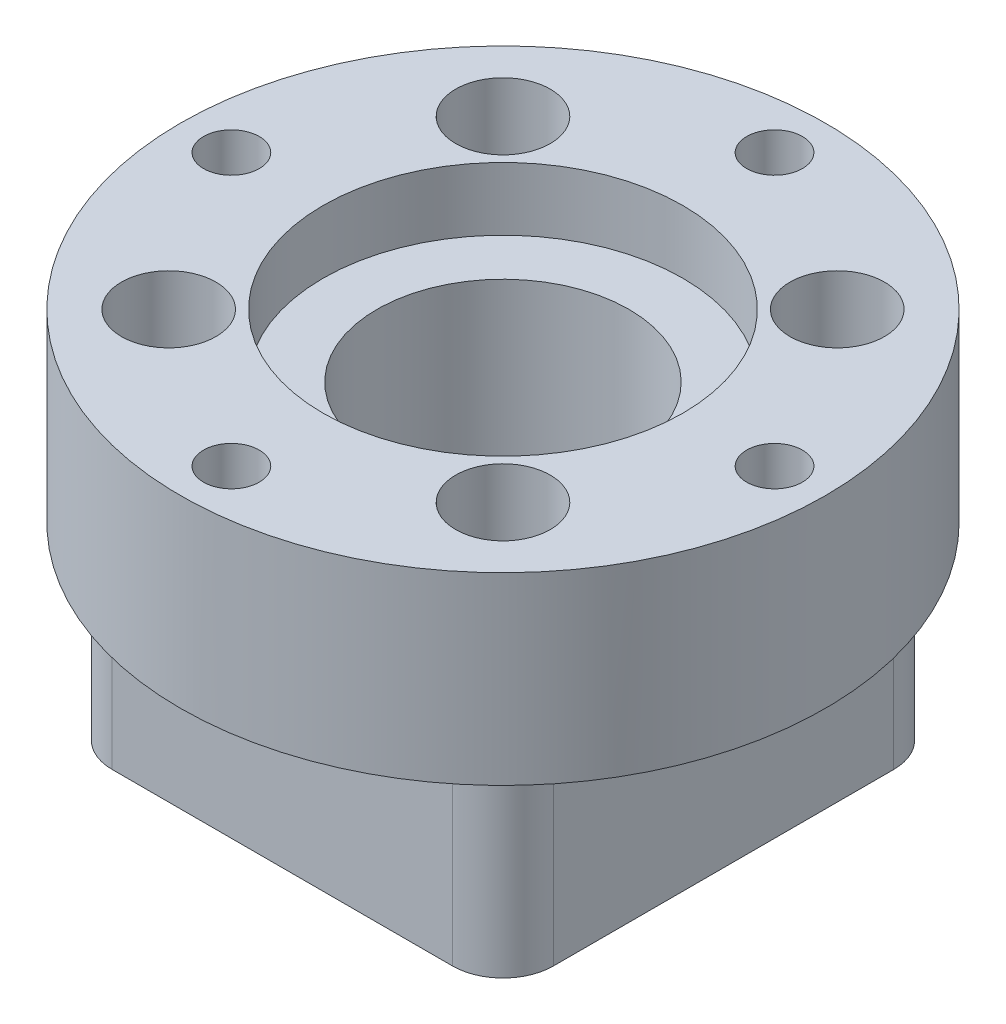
ISO-10303-21;
HEADER;
FILE_DESCRIPTION(('STEP AP214'),'2;1');
FILE_NAME('part.step','',(''),(''),'','','');
FILE_SCHEMA(('AUTOMOTIVE_DESIGN { 1 0 10303 214 1 1 1 1 }'));
ENDSEC;
DATA;
#1=APPLICATION_CONTEXT('core data for automotive mechanical design processes');
#2=APPLICATION_PROTOCOL_DEFINITION('international standard','automotive_design',2000,#1);
#3=PRODUCT_CONTEXT('',#1,'mechanical');
#4=PRODUCT('Part','Part','',(#3));
#5=PRODUCT_RELATED_PRODUCT_CATEGORY('part','',(#4));
#6=PRODUCT_DEFINITION_FORMATION('','',#4);
#7=PRODUCT_DEFINITION_CONTEXT('part definition',#1,'design');
#8=PRODUCT_DEFINITION('design','',#6,#7);
#9=PRODUCT_DEFINITION_SHAPE('','',#8);
#10=(LENGTH_UNIT() NAMED_UNIT(*) SI_UNIT(.MILLI.,.METRE.));
#11=(NAMED_UNIT(*) PLANE_ANGLE_UNIT() SI_UNIT($,.RADIAN.));
#12=(NAMED_UNIT(*) SI_UNIT($,.STERADIAN.) SOLID_ANGLE_UNIT());
#13=UNCERTAINTY_MEASURE_WITH_UNIT(LENGTH_MEASURE(1.E-05),#10,'distance_accuracy_value','');
#14=(GEOMETRIC_REPRESENTATION_CONTEXT(3) GLOBAL_UNCERTAINTY_ASSIGNED_CONTEXT((#13)) GLOBAL_UNIT_ASSIGNED_CONTEXT((#10,
#11,#12)) REPRESENTATION_CONTEXT('',''));
#15=CARTESIAN_POINT('',(0.,0.,0.));
#16=DIRECTION('',(0.,0.,1.));
#17=DIRECTION('',(1.,0.,0.));
#18=AXIS2_PLACEMENT_3D('',#15,#16,#17);
#19=CARTESIAN_POINT('',(0.,0.,0.));
#20=DIRECTION('',(0.,-1.,0.));
#21=DIRECTION('',(0.,0.,-1.));
#22=AXIS2_PLACEMENT_3D('',#19,#20,#21);
#23=PLANE('',#22);
#24=CARTESIAN_POINT('',(16.8401999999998,-4.71844785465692E-13,16.8402000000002));
#25=DIRECTION('',(0.,1.,0.));
#26=DIRECTION('',(0.,0.,1.));
#27=AXIS2_PLACEMENT_3D('',#24,#25,#26);
#28=CIRCLE('',#27,2.55269999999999);
#29=CARTESIAN_POINT('',(16.8401999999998,-4.71844785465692E-13,19.3929000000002));
#30=VERTEX_POINT('',#29);
#31=EDGE_CURVE('E265',#30,#30,#28,.T.);
#32=ORIENTED_EDGE('',*,*,#31,.T.);
#33=EDGE_LOOP('',(#32));
#34=FACE_BOUND('',#33,.T.);
#35=CARTESIAN_POINT('',(16.8402000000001,-4.71844785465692E-13,-16.8402));
#36=DIRECTION('',(0.,1.,0.));
#37=DIRECTION('',(0.,0.,1.));
#38=AXIS2_PLACEMENT_3D('',#35,#36,#37);
#39=CIRCLE('',#38,2.55269999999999);
#40=CARTESIAN_POINT('',(16.8402000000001,-4.71844785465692E-13,-14.2875));
#41=VERTEX_POINT('',#40);
#42=EDGE_CURVE('E253',#41,#41,#39,.T.);
#43=ORIENTED_EDGE('',*,*,#42,.T.);
#44=EDGE_LOOP('',(#43));
#45=FACE_BOUND('',#44,.T.);
#46=CARTESIAN_POINT('',(-16.8401999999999,-4.71844785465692E-13,-16.8402000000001));
#47=DIRECTION('',(0.,1.,0.));
#48=DIRECTION('',(0.,0.,1.));
#49=AXIS2_PLACEMENT_3D('',#46,#47,#48);
#50=CIRCLE('',#49,2.55269999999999);
#51=CARTESIAN_POINT('',(-16.8401999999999,-4.71844785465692E-13,-14.2875000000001));
#52=VERTEX_POINT('',#51);
#53=EDGE_CURVE('E241',#52,#52,#50,.T.);
#54=ORIENTED_EDGE('',*,*,#53,.T.);
#55=EDGE_LOOP('',(#54));
#56=FACE_BOUND('',#55,.T.);
#57=CARTESIAN_POINT('',(-16.8402000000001,-4.71844785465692E-13,16.8402));
#58=DIRECTION('',(0.,1.,0.));
#59=DIRECTION('',(0.,0.,1.));
#60=AXIS2_PLACEMENT_3D('',#57,#58,#59);
#61=CIRCLE('',#60,2.55269999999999);
#62=CARTESIAN_POINT('',(-16.8402000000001,-4.71844785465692E-13,19.3929));
#63=VERTEX_POINT('',#62);
#64=EDGE_CURVE('E229',#63,#63,#61,.T.);
#65=ORIENTED_EDGE('',*,*,#64,.T.);
#66=EDGE_LOOP('',(#65));
#67=FACE_BOUND('',#66,.T.);
#68=DIRECTION('',(0.,0.,1.));
#69=VECTOR('',#68,1.);
#70=CARTESIAN_POINT('',(-22.225,0.,22.225));
#71=LINE('',#70,#69);
#72=CARTESIAN_POINT('',(-22.225,0.,-17.145));
#73=VERTEX_POINT('',#72);
#74=CARTESIAN_POINT('',(-22.225,0.,17.145));
#75=VERTEX_POINT('',#74);
#76=EDGE_CURVE('E149',#73,#75,#71,.T.);
#77=ORIENTED_EDGE('',*,*,#76,.F.);
#78=CARTESIAN_POINT('',(-17.145,0.,-17.145));
#79=DIRECTION('',(0.,-1.,0.));
#80=DIRECTION('',(0.,0.,-1.));
#81=AXIS2_PLACEMENT_3D('',#78,#79,#80);
#82=CIRCLE('',#81,5.08);
#83=CARTESIAN_POINT('',(-17.145,0.,-22.225));
#84=VERTEX_POINT('',#83);
#85=EDGE_CURVE('E167',#73,#84,#82,.T.);
#86=ORIENTED_EDGE('',*,*,#85,.T.);
#87=DIRECTION('',(-1.,0.,0.));
#88=VECTOR('',#87,1.);
#89=CARTESIAN_POINT('',(-22.225,0.,-22.225));
#90=LINE('',#89,#88);
#91=CARTESIAN_POINT('',(17.145,0.,-22.225));
#92=VERTEX_POINT('',#91);
#93=EDGE_CURVE('E145',#92,#84,#90,.T.);
#94=ORIENTED_EDGE('',*,*,#93,.F.);
#95=CARTESIAN_POINT('',(17.145,0.,-17.145));
#96=DIRECTION('',(0.,-1.,0.));
#97=DIRECTION('',(0.,0.,-1.));
#98=AXIS2_PLACEMENT_3D('',#95,#96,#97);
#99=CIRCLE('',#98,5.08);
#100=CARTESIAN_POINT('',(22.225,0.,-17.145));
#101=VERTEX_POINT('',#100);
#102=EDGE_CURVE('E144',#92,#101,#99,.T.);
#103=ORIENTED_EDGE('',*,*,#102,.T.);
#104=DIRECTION('',(0.,0.,-1.));
#105=VECTOR('',#104,1.);
#106=CARTESIAN_POINT('',(22.225,0.,22.225));
#107=LINE('',#106,#105);
#108=CARTESIAN_POINT('',(22.225,0.,17.145));
#109=VERTEX_POINT('',#108);
#110=EDGE_CURVE('E135',#109,#101,#107,.T.);
#111=ORIENTED_EDGE('',*,*,#110,.F.);
#112=CARTESIAN_POINT('',(17.145,0.,17.145));
#113=DIRECTION('',(0.,-1.,0.));
#114=DIRECTION('',(0.,0.,-1.));
#115=AXIS2_PLACEMENT_3D('',#112,#113,#114);
#116=CIRCLE('',#115,5.08);
#117=CARTESIAN_POINT('',(17.145,0.,22.225));
#118=VERTEX_POINT('',#117);
#119=EDGE_CURVE('E142',#109,#118,#116,.T.);
#120=ORIENTED_EDGE('',*,*,#119,.T.);
#121=DIRECTION('',(1.,0.,0.));
#122=VECTOR('',#121,1.);
#123=CARTESIAN_POINT('',(-22.225,0.,22.225));
#124=LINE('',#123,#122);
#125=CARTESIAN_POINT('',(-17.145,0.,22.225));
#126=VERTEX_POINT('',#125);
#127=EDGE_CURVE('E158',#126,#118,#124,.T.);
#128=ORIENTED_EDGE('',*,*,#127,.F.);
#129=CARTESIAN_POINT('',(-17.145,0.,17.145));
#130=DIRECTION('',(0.,-1.,0.));
#131=DIRECTION('',(0.,0.,-1.));
#132=AXIS2_PLACEMENT_3D('',#129,#130,#131);
#133=CIRCLE('',#132,5.08);
#134=EDGE_CURVE('E103',#126,#75,#133,.T.);
#135=ORIENTED_EDGE('',*,*,#134,.T.);
#136=EDGE_LOOP('',(#77,#86,#94,#103,#111,#120,#128,#135));
#137=FACE_BOUND('',#136,.T.);
#138=CARTESIAN_POINT('',(0.,0.,0.));
#139=DIRECTION('',(0.,-1.,0.));
#140=DIRECTION('',(0.,0.,-1.));
#141=AXIS2_PLACEMENT_3D('',#138,#139,#140);
#142=CIRCLE('',#141,19.1008);
#143=CARTESIAN_POINT('',(0.,0.,-19.1008));
#144=VERTEX_POINT('',#143);
#145=EDGE_CURVE('E187',#144,#144,#142,.T.);
#146=ORIENTED_EDGE('',*,*,#145,.F.);
#147=EDGE_LOOP('',(#146));
#148=FACE_BOUND('',#147,.T.);
#149=ADVANCED_FACE('F33',(#34,#45,#56,#67,#137,#148),#23,.T.);
#150=CARTESIAN_POINT('',(-2.77555756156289E-13,37.6147456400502,-1.74647848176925E-13));
#151=DIRECTION('',(0.,1.,0.));
#152=DIRECTION('',(0.782657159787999,0.,0.622453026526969));
#153=AXIS2_PLACEMENT_3D('',#150,#151,#152);
#154=PLANE('',#153);
#155=CARTESIAN_POINT('',(16.8401999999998,37.6147456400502,16.8402000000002));
#156=DIRECTION('',(0.,1.,0.));
#157=DIRECTION('',(0.,0.,1.));
#158=AXIS2_PLACEMENT_3D('',#155,#156,#157);
#159=CIRCLE('',#158,4.76249999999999);
#160=CARTESIAN_POINT('',(16.8401999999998,37.6147456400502,21.6027000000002));
#161=VERTEX_POINT('',#160);
#162=EDGE_CURVE('E274',#161,#161,#159,.T.);
#163=ORIENTED_EDGE('',*,*,#162,.F.);
#164=EDGE_LOOP('',(#163));
#165=FACE_BOUND('',#164,.T.);
#166=CARTESIAN_POINT('',(16.8402000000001,37.6147456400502,-16.8402));
#167=DIRECTION('',(0.,1.,0.));
#168=DIRECTION('',(0.,0.,1.));
#169=AXIS2_PLACEMENT_3D('',#166,#167,#168);
#170=CIRCLE('',#169,4.76249999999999);
#171=CARTESIAN_POINT('',(16.8402000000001,37.6147456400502,-12.0777));
#172=VERTEX_POINT('',#171);
#173=EDGE_CURVE('E262',#172,#172,#170,.T.);
#174=ORIENTED_EDGE('',*,*,#173,.F.);
#175=EDGE_LOOP('',(#174));
#176=FACE_BOUND('',#175,.T.);
#177=CARTESIAN_POINT('',(-16.8401999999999,37.6147456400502,-16.8402000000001));
#178=DIRECTION('',(0.,1.,0.));
#179=DIRECTION('',(0.,0.,1.));
#180=AXIS2_PLACEMENT_3D('',#177,#178,#179);
#181=CIRCLE('',#180,4.76249999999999);
#182=CARTESIAN_POINT('',(-16.8401999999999,37.6147456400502,-12.0777000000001));
#183=VERTEX_POINT('',#182);
#184=EDGE_CURVE('E250',#183,#183,#181,.T.);
#185=ORIENTED_EDGE('',*,*,#184,.F.);
#186=EDGE_LOOP('',(#185));
#187=FACE_BOUND('',#186,.T.);
#188=CARTESIAN_POINT('',(-16.8402000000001,37.6147456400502,16.8402));
#189=DIRECTION('',(0.,1.,0.));
#190=DIRECTION('',(0.,0.,1.));
#191=AXIS2_PLACEMENT_3D('',#188,#189,#190);
#192=CIRCLE('',#191,4.76249999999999);
#193=CARTESIAN_POINT('',(-16.8402000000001,37.6147456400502,21.6027));
#194=VERTEX_POINT('',#193);
#195=EDGE_CURVE('E238',#194,#194,#192,.T.);
#196=ORIENTED_EDGE('',*,*,#195,.F.);
#197=EDGE_LOOP('',(#196));
#198=FACE_BOUND('',#197,.T.);
#199=CARTESIAN_POINT('',(-3.01545159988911E-13,37.6147456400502,27.3625000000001));
#200=DIRECTION('',(0.,1.,0.));
#201=DIRECTION('',(0.,0.,1.));
#202=AXIS2_PLACEMENT_3D('',#199,#200,#201);
#203=CIRCLE('',#202,2.8067);
#204=CARTESIAN_POINT('',(-3.01545159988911E-13,37.6147456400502,30.1692000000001));
#205=VERTEX_POINT('',#204);
#206=EDGE_CURVE('E226',#205,#205,#203,.T.);
#207=ORIENTED_EDGE('',*,*,#206,.F.);
#208=EDGE_LOOP('',(#207));
#209=FACE_BOUND('',#208,.T.);
#210=CARTESIAN_POINT('',(27.3625000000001,37.6147456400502,0.));
#211=DIRECTION('',(0.,1.,0.));
#212=DIRECTION('',(0.,0.,1.));
#213=AXIS2_PLACEMENT_3D('',#210,#211,#212);
#214=CIRCLE('',#213,2.8067);
#215=CARTESIAN_POINT('',(27.3625000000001,37.6147456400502,2.80670000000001));
#216=VERTEX_POINT('',#215);
#217=EDGE_CURVE('E220',#216,#216,#214,.T.);
#218=ORIENTED_EDGE('',*,*,#217,.F.);
#219=EDGE_LOOP('',(#218));
#220=FACE_BOUND('',#219,.T.);
#221=CARTESIAN_POINT('',(1.1047384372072E-13,37.6147456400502,-27.3625000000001));
#222=DIRECTION('',(0.,1.,0.));
#223=DIRECTION('',(0.,0.,1.));
#224=AXIS2_PLACEMENT_3D('',#221,#222,#223);
#225=CIRCLE('',#224,2.8067);
#226=CARTESIAN_POINT('',(1.1047384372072E-13,37.6147456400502,-24.5558000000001));
#227=VERTEX_POINT('',#226);
#228=EDGE_CURVE('E214',#227,#227,#225,.T.);
#229=ORIENTED_EDGE('',*,*,#228,.F.);
#230=EDGE_LOOP('',(#229));
#231=FACE_BOUND('',#230,.T.);
#232=CARTESIAN_POINT('',(-27.3625000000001,37.6147456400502,0.));
#233=DIRECTION('',(0.,1.,0.));
#234=DIRECTION('',(0.,0.,1.));
#235=AXIS2_PLACEMENT_3D('',#232,#233,#234);
#236=CIRCLE('',#235,2.8067);
#237=CARTESIAN_POINT('',(-27.3625000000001,37.6147456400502,2.80669999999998));
#238=VERTEX_POINT('',#237);
#239=EDGE_CURVE('E208',#238,#238,#236,.T.);
#240=ORIENTED_EDGE('',*,*,#239,.F.);
#241=EDGE_LOOP('',(#240));
#242=FACE_BOUND('',#241,.T.);
#243=CARTESIAN_POINT('',(0.,37.6147456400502,0.));
#244=DIRECTION('',(0.,1.,0.));
#245=DIRECTION('',(-1.,0.,0.));
#246=AXIS2_PLACEMENT_3D('',#243,#244,#245);
#247=CIRCLE('',#246,32.5);
#248=CARTESIAN_POINT('',(-32.5,37.6147456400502,0.));
#249=VERTEX_POINT('',#248);
#250=EDGE_CURVE('E146',#249,#249,#247,.T.);
#251=ORIENTED_EDGE('',*,*,#250,.T.);
#252=EDGE_LOOP('',(#251));
#253=FACE_BOUND('',#252,.T.);
#254=CARTESIAN_POINT('',(0.,37.6147456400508,0.));
#255=DIRECTION('',(0.,-1.,0.));
#256=DIRECTION('',(0.,0.,-1.));
#257=AXIS2_PLACEMENT_3D('',#254,#255,#256);
#258=CIRCLE('',#257,18.127);
#259=CARTESIAN_POINT('',(0.,37.6147456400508,-18.127));
#260=VERTEX_POINT('',#259);
#261=EDGE_CURVE('E202',#260,#260,#258,.T.);
#262=ORIENTED_EDGE('',*,*,#261,.T.);
#263=EDGE_LOOP('',(#262));
#264=FACE_BOUND('',#263,.T.);
#265=ADVANCED_FACE('F280',(#165,#176,#187,#198,#209,#220,#231,#242,#253,#264),#154,.T.);
#266=CARTESIAN_POINT('',(22.225,19.05,22.225));
#267=DIRECTION('',(-1.,0.,0.));
#268=DIRECTION('',(0.,0.,1.));
#269=AXIS2_PLACEMENT_3D('',#266,#267,#268);
#270=PLANE('',#269);
#271=ORIENTED_EDGE('',*,*,#110,.T.);
#272=DIRECTION('',(0.,-1.,0.));
#273=VECTOR('',#272,1.);
#274=CARTESIAN_POINT('',(22.225,19.05,-17.145));
#275=LINE('',#274,#273);
#276=CARTESIAN_POINT('',(22.225,19.05,-17.145));
#277=VERTEX_POINT('',#276);
#278=EDGE_CURVE('E54',#101,#277,#275,.F.);
#279=ORIENTED_EDGE('',*,*,#278,.T.);
#280=DIRECTION('',(0.,0.,-1.));
#281=VECTOR('',#280,1.);
#282=CARTESIAN_POINT('',(22.225,19.05,22.225));
#283=LINE('',#282,#281);
#284=CARTESIAN_POINT('',(22.225,19.05,17.145));
#285=VERTEX_POINT('',#284);
#286=EDGE_CURVE('E137',#285,#277,#283,.T.);
#287=ORIENTED_EDGE('',*,*,#286,.F.);
#288=DIRECTION('',(0.,-1.,0.));
#289=VECTOR('',#288,1.);
#290=CARTESIAN_POINT('',(22.225,19.05,17.145));
#291=LINE('',#290,#289);
#292=EDGE_CURVE('E129',#285,#109,#291,.T.);
#293=ORIENTED_EDGE('',*,*,#292,.T.);
#294=EDGE_LOOP('',(#271,#279,#287,#293));
#295=FACE_BOUND('',#294,.T.);
#296=ADVANCED_FACE('F134',(#295),#270,.F.);
#297=CARTESIAN_POINT('',(-22.225,19.05,-22.225));
#298=DIRECTION('',(0.,0.,1.));
#299=DIRECTION('',(1.,0.,0.));
#300=AXIS2_PLACEMENT_3D('',#297,#298,#299);
#301=PLANE('',#300);
#302=ORIENTED_EDGE('',*,*,#93,.T.);
#303=DIRECTION('',(0.,-1.,0.));
#304=VECTOR('',#303,1.);
#305=CARTESIAN_POINT('',(-17.145,19.05,-22.225));
#306=LINE('',#305,#304);
#307=CARTESIAN_POINT('',(-17.145,19.05,-22.225));
#308=VERTEX_POINT('',#307);
#309=EDGE_CURVE('E118',#84,#308,#306,.F.);
#310=ORIENTED_EDGE('',*,*,#309,.T.);
#311=DIRECTION('',(-1.,0.,0.));
#312=VECTOR('',#311,1.);
#313=CARTESIAN_POINT('',(-22.225,19.05,-22.225));
#314=LINE('',#313,#312);
#315=CARTESIAN_POINT('',(17.145,19.05,-22.225));
#316=VERTEX_POINT('',#315);
#317=EDGE_CURVE('E174',#316,#308,#314,.T.);
#318=ORIENTED_EDGE('',*,*,#317,.F.);
#319=DIRECTION('',(0.,-1.,0.));
#320=VECTOR('',#319,1.);
#321=CARTESIAN_POINT('',(17.145,19.05,-22.225));
#322=LINE('',#321,#320);
#323=EDGE_CURVE('E122',#316,#92,#322,.T.);
#324=ORIENTED_EDGE('',*,*,#323,.T.);
#325=EDGE_LOOP('',(#302,#310,#318,#324));
#326=FACE_BOUND('',#325,.T.);
#327=ADVANCED_FACE('F171',(#326),#301,.F.);
#328=CARTESIAN_POINT('',(-22.225,19.05,22.225));
#329=DIRECTION('',(1.,0.,0.));
#330=DIRECTION('',(0.,0.,-1.));
#331=AXIS2_PLACEMENT_3D('',#328,#329,#330);
#332=PLANE('',#331);
#333=DIRECTION('',(0.,0.,1.));
#334=VECTOR('',#333,1.);
#335=CARTESIAN_POINT('',(-22.225,19.05,22.225));
#336=LINE('',#335,#334);
#337=CARTESIAN_POINT('',(-22.225,19.05,-17.145));
#338=VERTEX_POINT('',#337);
#339=CARTESIAN_POINT('',(-22.225,19.05,17.145));
#340=VERTEX_POINT('',#339);
#341=EDGE_CURVE('E111',#338,#340,#336,.T.);
#342=ORIENTED_EDGE('',*,*,#341,.F.);
#343=DIRECTION('',(0.,-1.,0.));
#344=VECTOR('',#343,1.);
#345=CARTESIAN_POINT('',(-22.225,19.05,-17.145));
#346=LINE('',#345,#344);
#347=EDGE_CURVE('E161',#338,#73,#346,.T.);
#348=ORIENTED_EDGE('',*,*,#347,.T.);
#349=ORIENTED_EDGE('',*,*,#76,.T.);
#350=DIRECTION('',(0.,-1.,0.));
#351=VECTOR('',#350,1.);
#352=CARTESIAN_POINT('',(-22.225,19.05,17.145));
#353=LINE('',#352,#351);
#354=EDGE_CURVE('E110',#75,#340,#353,.F.);
#355=ORIENTED_EDGE('',*,*,#354,.T.);
#356=EDGE_LOOP('',(#342,#348,#349,#355));
#357=FACE_BOUND('',#356,.T.);
#358=ADVANCED_FACE('F181',(#357),#332,.F.);
#359=CARTESIAN_POINT('',(-22.225,19.05,22.225));
#360=DIRECTION('',(0.,0.,-1.));
#361=DIRECTION('',(-1.,0.,0.));
#362=AXIS2_PLACEMENT_3D('',#359,#360,#361);
#363=PLANE('',#362);
#364=ORIENTED_EDGE('',*,*,#127,.T.);
#365=DIRECTION('',(0.,-1.,0.));
#366=VECTOR('',#365,1.);
#367=CARTESIAN_POINT('',(17.145,19.05,22.225));
#368=LINE('',#367,#366);
#369=CARTESIAN_POINT('',(17.145,19.05,22.225));
#370=VERTEX_POINT('',#369);
#371=EDGE_CURVE('E11',#118,#370,#368,.F.);
#372=ORIENTED_EDGE('',*,*,#371,.T.);
#373=DIRECTION('',(1.,0.,0.));
#374=VECTOR('',#373,1.);
#375=CARTESIAN_POINT('',(-22.225,19.05,22.225));
#376=LINE('',#375,#374);
#377=CARTESIAN_POINT('',(-17.145,19.05,22.225));
#378=VERTEX_POINT('',#377);
#379=EDGE_CURVE('E106',#378,#370,#376,.T.);
#380=ORIENTED_EDGE('',*,*,#379,.F.);
#381=DIRECTION('',(0.,-1.,0.));
#382=VECTOR('',#381,1.);
#383=CARTESIAN_POINT('',(-17.145,19.05,22.225));
#384=LINE('',#383,#382);
#385=EDGE_CURVE('E41',#378,#126,#384,.T.);
#386=ORIENTED_EDGE('',*,*,#385,.T.);
#387=EDGE_LOOP('',(#364,#372,#380,#386));
#388=FACE_BOUND('',#387,.T.);
#389=ADVANCED_FACE('F107',(#388),#363,.F.);
#390=CARTESIAN_POINT('',(-17.145,19.05,-17.145));
#391=DIRECTION('',(0.,-1.,0.));
#392=DIRECTION('',(0.,0.,-1.));
#393=AXIS2_PLACEMENT_3D('',#390,#391,#392);
#394=CYLINDRICAL_SURFACE('',#393,5.08);
#395=CARTESIAN_POINT('',(-17.145,19.05,-17.145));
#396=DIRECTION('',(0.,-1.,0.));
#397=DIRECTION('',(0.,0.,-1.));
#398=AXIS2_PLACEMENT_3D('',#395,#396,#397);
#399=CIRCLE('',#398,5.08);
#400=EDGE_CURVE('E127',#308,#338,#399,.F.);
#401=ORIENTED_EDGE('',*,*,#400,.F.);
#402=ORIENTED_EDGE('',*,*,#309,.F.);
#403=ORIENTED_EDGE('',*,*,#85,.F.);
#404=ORIENTED_EDGE('',*,*,#347,.F.);
#405=EDGE_LOOP('',(#401,#402,#403,#404));
#406=FACE_BOUND('',#405,.T.);
#407=ADVANCED_FACE('F179',(#406),#394,.T.);
#408=CARTESIAN_POINT('',(17.145,19.05,-17.145));
#409=DIRECTION('',(0.,-1.,0.));
#410=DIRECTION('',(0.,0.,-1.));
#411=AXIS2_PLACEMENT_3D('',#408,#409,#410);
#412=CYLINDRICAL_SURFACE('',#411,5.08);
#413=CARTESIAN_POINT('',(17.145,19.05,-17.145));
#414=DIRECTION('',(0.,-1.,0.));
#415=DIRECTION('',(0.,0.,-1.));
#416=AXIS2_PLACEMENT_3D('',#413,#414,#415);
#417=CIRCLE('',#416,5.08);
#418=EDGE_CURVE('E120',#277,#316,#417,.F.);
#419=ORIENTED_EDGE('',*,*,#418,.F.);
#420=ORIENTED_EDGE('',*,*,#278,.F.);
#421=ORIENTED_EDGE('',*,*,#102,.F.);
#422=ORIENTED_EDGE('',*,*,#323,.F.);
#423=EDGE_LOOP('',(#419,#420,#421,#422));
#424=FACE_BOUND('',#423,.T.);
#425=ADVANCED_FACE('F336',(#424),#412,.T.);
#426=CARTESIAN_POINT('',(17.145,19.05,17.145));
#427=DIRECTION('',(0.,-1.,0.));
#428=DIRECTION('',(0.,0.,-1.));
#429=AXIS2_PLACEMENT_3D('',#426,#427,#428);
#430=CYLINDRICAL_SURFACE('',#429,5.08);
#431=CARTESIAN_POINT('',(17.145,19.05,17.145));
#432=DIRECTION('',(0.,-1.,0.));
#433=DIRECTION('',(0.,0.,-1.));
#434=AXIS2_PLACEMENT_3D('',#431,#432,#433);
#435=CIRCLE('',#434,5.08);
#436=EDGE_CURVE('E117',#370,#285,#435,.F.);
#437=ORIENTED_EDGE('',*,*,#436,.F.);
#438=ORIENTED_EDGE('',*,*,#371,.F.);
#439=ORIENTED_EDGE('',*,*,#119,.F.);
#440=ORIENTED_EDGE('',*,*,#292,.F.);
#441=EDGE_LOOP('',(#437,#438,#439,#440));
#442=FACE_BOUND('',#441,.T.);
#443=ADVANCED_FACE('F338',(#442),#430,.T.);
#444=CARTESIAN_POINT('',(-17.145,19.05,17.145));
#445=DIRECTION('',(0.,-1.,0.));
#446=DIRECTION('',(0.,0.,-1.));
#447=AXIS2_PLACEMENT_3D('',#444,#445,#446);
#448=CYLINDRICAL_SURFACE('',#447,5.08);
#449=CARTESIAN_POINT('',(-17.145,19.05,17.145));
#450=DIRECTION('',(0.,-1.,0.));
#451=DIRECTION('',(0.,0.,-1.));
#452=AXIS2_PLACEMENT_3D('',#449,#450,#451);
#453=CIRCLE('',#452,5.08);
#454=EDGE_CURVE('E101',#340,#378,#453,.F.);
#455=ORIENTED_EDGE('',*,*,#454,.F.);
#456=ORIENTED_EDGE('',*,*,#354,.F.);
#457=ORIENTED_EDGE('',*,*,#134,.F.);
#458=ORIENTED_EDGE('',*,*,#385,.F.);
#459=EDGE_LOOP('',(#455,#456,#457,#458));
#460=FACE_BOUND('',#459,.T.);
#461=ADVANCED_FACE('F35',(#460),#448,.T.);
#462=CARTESIAN_POINT('',(0.,129.538627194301,0.));
#463=DIRECTION('',(0.,-1.,0.));
#464=DIRECTION('',(0.,0.,-1.));
#465=AXIS2_PLACEMENT_3D('',#462,#463,#464);
#466=CYLINDRICAL_SURFACE('',#465,32.5);
#467=CARTESIAN_POINT('',(0.,19.05,0.));
#468=DIRECTION('',(0.,1.,0.));
#469=DIRECTION('',(0.,0.,1.));
#470=AXIS2_PLACEMENT_3D('',#467,#468,#469);
#471=CIRCLE('',#470,32.5);
#472=CARTESIAN_POINT('',(0.,19.05,32.5));
#473=VERTEX_POINT('',#472);
#474=EDGE_CURVE('E152',#473,#473,#471,.T.);
#475=ORIENTED_EDGE('',*,*,#474,.T.);
#476=EDGE_LOOP('',(#475));
#477=FACE_BOUND('',#476,.T.);
#478=ORIENTED_EDGE('',*,*,#250,.F.);
#479=EDGE_LOOP('',(#478));
#480=FACE_BOUND('',#479,.T.);
#481=ADVANCED_FACE('F343',(#477,#480),#466,.T.);
#482=CARTESIAN_POINT('',(0.,19.05,0.));
#483=DIRECTION('',(0.,1.,0.));
#484=DIRECTION('',(0.,0.,1.));
#485=AXIS2_PLACEMENT_3D('',#482,#483,#484);
#486=PLANE('',#485);
#487=CARTESIAN_POINT('',(-3.01545159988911E-13,19.05,27.3625000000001));
#488=DIRECTION('',(0.,1.,0.));
#489=DIRECTION('',(0.,0.,1.));
#490=AXIS2_PLACEMENT_3D('',#487,#488,#489);
#491=CIRCLE('',#490,2.8067);
#492=CARTESIAN_POINT('',(-3.01545159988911E-13,19.05,30.1692000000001));
#493=VERTEX_POINT('',#492);
#494=EDGE_CURVE('E223',#493,#493,#491,.T.);
#495=ORIENTED_EDGE('',*,*,#494,.T.);
#496=EDGE_LOOP('',(#495));
#497=FACE_BOUND('',#496,.T.);
#498=CARTESIAN_POINT('',(27.3625000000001,19.05,0.));
#499=DIRECTION('',(0.,1.,0.));
#500=DIRECTION('',(0.,0.,1.));
#501=AXIS2_PLACEMENT_3D('',#498,#499,#500);
#502=CIRCLE('',#501,2.8067);
#503=CARTESIAN_POINT('',(27.3625000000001,19.05,2.80670000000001));
#504=VERTEX_POINT('',#503);
#505=EDGE_CURVE('E217',#504,#504,#502,.T.);
#506=ORIENTED_EDGE('',*,*,#505,.T.);
#507=EDGE_LOOP('',(#506));
#508=FACE_BOUND('',#507,.T.);
#509=CARTESIAN_POINT('',(1.1047384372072E-13,19.05,-27.3625000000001));
#510=DIRECTION('',(0.,1.,0.));
#511=DIRECTION('',(0.,0.,1.));
#512=AXIS2_PLACEMENT_3D('',#509,#510,#511);
#513=CIRCLE('',#512,2.8067);
#514=CARTESIAN_POINT('',(1.1047384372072E-13,19.05,-24.5558000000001));
#515=VERTEX_POINT('',#514);
#516=EDGE_CURVE('E211',#515,#515,#513,.T.);
#517=ORIENTED_EDGE('',*,*,#516,.T.);
#518=EDGE_LOOP('',(#517));
#519=FACE_BOUND('',#518,.T.);
#520=CARTESIAN_POINT('',(-27.3625000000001,19.05,0.));
#521=DIRECTION('',(0.,1.,0.));
#522=DIRECTION('',(0.,0.,1.));
#523=AXIS2_PLACEMENT_3D('',#520,#521,#522);
#524=CIRCLE('',#523,2.8067);
#525=CARTESIAN_POINT('',(-27.3625000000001,19.05,2.80669999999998));
#526=VERTEX_POINT('',#525);
#527=EDGE_CURVE('E205',#526,#526,#524,.T.);
#528=ORIENTED_EDGE('',*,*,#527,.T.);
#529=EDGE_LOOP('',(#528));
#530=FACE_BOUND('',#529,.T.);
#531=ORIENTED_EDGE('',*,*,#418,.T.);
#532=ORIENTED_EDGE('',*,*,#317,.T.);
#533=ORIENTED_EDGE('',*,*,#400,.T.);
#534=ORIENTED_EDGE('',*,*,#341,.T.);
#535=ORIENTED_EDGE('',*,*,#454,.T.);
#536=ORIENTED_EDGE('',*,*,#379,.T.);
#537=ORIENTED_EDGE('',*,*,#436,.T.);
#538=ORIENTED_EDGE('',*,*,#286,.T.);
#539=EDGE_LOOP('',(#531,#532,#533,#534,#535,#536,#537,#538));
#540=FACE_BOUND('',#539,.T.);
#541=ORIENTED_EDGE('',*,*,#474,.F.);
#542=EDGE_LOOP('',(#541));
#543=FACE_BOUND('',#542,.T.);
#544=ADVANCED_FACE('F114',(#497,#508,#519,#530,#540,#543),#486,.F.);
#545=CARTESIAN_POINT('',(0.,0.,0.));
#546=DIRECTION('',(0.,-1.,0.));
#547=DIRECTION('',(0.,0.,-1.));
#548=AXIS2_PLACEMENT_3D('',#545,#546,#547);
#549=CYLINDRICAL_SURFACE('',#548,19.1008);
#550=ORIENTED_EDGE('',*,*,#145,.T.);
#551=EDGE_LOOP('',(#550));
#552=FACE_BOUND('',#551,.T.);
#553=CARTESIAN_POINT('',(0.,7.62,0.));
#554=DIRECTION('',(0.,-1.,0.));
#555=DIRECTION('',(0.,0.,-1.));
#556=AXIS2_PLACEMENT_3D('',#553,#554,#555);
#557=CIRCLE('',#556,19.1008);
#558=CARTESIAN_POINT('',(0.,7.62,-19.1008));
#559=VERTEX_POINT('',#558);
#560=EDGE_CURVE('E190',#559,#559,#557,.T.);
#561=ORIENTED_EDGE('',*,*,#560,.F.);
#562=EDGE_LOOP('',(#561));
#563=FACE_BOUND('',#562,.T.);
#564=ADVANCED_FACE('F351',(#552,#563),#549,.F.);
#565=CARTESIAN_POINT('',(-19.1008,7.62,0.));
#566=DIRECTION('',(0.,-1.,0.));
#567=DIRECTION('',(0.,0.,-1.));
#568=AXIS2_PLACEMENT_3D('',#565,#566,#567);
#569=PLANE('',#568);
#570=ORIENTED_EDGE('',*,*,#560,.T.);
#571=EDGE_LOOP('',(#570));
#572=FACE_BOUND('',#571,.T.);
#573=CARTESIAN_POINT('',(0.,7.62,0.));
#574=DIRECTION('',(0.,-1.,0.));
#575=DIRECTION('',(0.,0.,-1.));
#576=AXIS2_PLACEMENT_3D('',#573,#574,#575);
#577=CIRCLE('',#576,12.7);
#578=CARTESIAN_POINT('',(0.,7.62,-12.7));
#579=VERTEX_POINT('',#578);
#580=EDGE_CURVE('E193',#579,#579,#577,.T.);
#581=ORIENTED_EDGE('',*,*,#580,.F.);
#582=EDGE_LOOP('',(#581));
#583=FACE_BOUND('',#582,.T.);
#584=ADVANCED_FACE('F358',(#572,#583),#569,.T.);
#585=CARTESIAN_POINT('',(0.,0.,0.));
#586=DIRECTION('',(0.,-1.,0.));
#587=DIRECTION('',(0.,0.,-1.));
#588=AXIS2_PLACEMENT_3D('',#585,#586,#587);
#589=CYLINDRICAL_SURFACE('',#588,12.7);
#590=ORIENTED_EDGE('',*,*,#580,.T.);
#591=EDGE_LOOP('',(#590));
#592=FACE_BOUND('',#591,.T.);
#593=CARTESIAN_POINT('',(0.,31.2647456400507,0.));
#594=DIRECTION('',(0.,-1.,0.));
#595=DIRECTION('',(0.,0.,-1.));
#596=AXIS2_PLACEMENT_3D('',#593,#594,#595);
#597=CIRCLE('',#596,12.7);
#598=CARTESIAN_POINT('',(0.,31.2647456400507,-12.7));
#599=VERTEX_POINT('',#598);
#600=EDGE_CURVE('E196',#599,#599,#597,.T.);
#601=ORIENTED_EDGE('',*,*,#600,.F.);
#602=EDGE_LOOP('',(#601));
#603=FACE_BOUND('',#602,.T.);
#604=ADVANCED_FACE('F315',(#592,#603),#589,.F.);
#605=CARTESIAN_POINT('',(-12.7,31.2647456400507,0.));
#606=DIRECTION('',(0.,1.,0.));
#607=DIRECTION('',(0.,0.,1.));
#608=AXIS2_PLACEMENT_3D('',#605,#606,#607);
#609=PLANE('',#608);
#610=ORIENTED_EDGE('',*,*,#600,.T.);
#611=EDGE_LOOP('',(#610));
#612=FACE_BOUND('',#611,.T.);
#613=CARTESIAN_POINT('',(0.,31.2647456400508,0.));
#614=DIRECTION('',(0.,-1.,0.));
#615=DIRECTION('',(0.,0.,-1.));
#616=AXIS2_PLACEMENT_3D('',#613,#614,#615);
#617=CIRCLE('',#616,18.127);
#618=CARTESIAN_POINT('',(0.,31.2647456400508,-18.127));
#619=VERTEX_POINT('',#618);
#620=EDGE_CURVE('E199',#619,#619,#617,.T.);
#621=ORIENTED_EDGE('',*,*,#620,.F.);
#622=EDGE_LOOP('',(#621));
#623=FACE_BOUND('',#622,.T.);
#624=ADVANCED_FACE('F305',(#612,#623),#609,.T.);
#625=CARTESIAN_POINT('',(0.,0.,0.));
#626=DIRECTION('',(0.,-1.,0.));
#627=DIRECTION('',(0.,0.,-1.));
#628=AXIS2_PLACEMENT_3D('',#625,#626,#627);
#629=CYLINDRICAL_SURFACE('',#628,18.127);
#630=ORIENTED_EDGE('',*,*,#620,.T.);
#631=EDGE_LOOP('',(#630));
#632=FACE_BOUND('',#631,.T.);
#633=ORIENTED_EDGE('',*,*,#261,.F.);
#634=EDGE_LOOP('',(#633));
#635=FACE_BOUND('',#634,.T.);
#636=ADVANCED_FACE('F302',(#632,#635),#629,.F.);
#637=CARTESIAN_POINT('',(-27.3625000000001,37.6147456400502,0.));
#638=DIRECTION('',(0.,1.,0.));
#639=DIRECTION('',(0.,0.,1.));
#640=AXIS2_PLACEMENT_3D('',#637,#638,#639);
#641=CYLINDRICAL_SURFACE('',#640,2.8067);
#642=ORIENTED_EDGE('',*,*,#527,.F.);
#643=EDGE_LOOP('',(#642));
#644=FACE_BOUND('',#643,.T.);
#645=ORIENTED_EDGE('',*,*,#239,.T.);
#646=EDGE_LOOP('',(#645));
#647=FACE_BOUND('',#646,.T.);
#648=ADVANCED_FACE('F304',(#644,#647),#641,.F.);
#649=CARTESIAN_POINT('',(1.1047384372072E-13,37.6147456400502,-27.3625000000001));
#650=DIRECTION('',(0.,1.,0.));
#651=DIRECTION('',(0.,0.,1.));
#652=AXIS2_PLACEMENT_3D('',#649,#650,#651);
#653=CYLINDRICAL_SURFACE('',#652,2.8067);
#654=ORIENTED_EDGE('',*,*,#516,.F.);
#655=EDGE_LOOP('',(#654));
#656=FACE_BOUND('',#655,.T.);
#657=ORIENTED_EDGE('',*,*,#228,.T.);
#658=EDGE_LOOP('',(#657));
#659=FACE_BOUND('',#658,.T.);
#660=ADVANCED_FACE('F312',(#656,#659),#653,.F.);
#661=CARTESIAN_POINT('',(27.3625000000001,37.6147456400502,0.));
#662=DIRECTION('',(0.,1.,0.));
#663=DIRECTION('',(0.,0.,1.));
#664=AXIS2_PLACEMENT_3D('',#661,#662,#663);
#665=CYLINDRICAL_SURFACE('',#664,2.8067);
#666=ORIENTED_EDGE('',*,*,#505,.F.);
#667=EDGE_LOOP('',(#666));
#668=FACE_BOUND('',#667,.T.);
#669=ORIENTED_EDGE('',*,*,#217,.T.);
#670=EDGE_LOOP('',(#669));
#671=FACE_BOUND('',#670,.T.);
#672=ADVANCED_FACE('F406',(#668,#671),#665,.F.);
#673=CARTESIAN_POINT('',(-3.01545159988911E-13,37.6147456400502,27.3625000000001));
#674=DIRECTION('',(0.,1.,0.));
#675=DIRECTION('',(0.,0.,1.));
#676=AXIS2_PLACEMENT_3D('',#673,#674,#675);
#677=CYLINDRICAL_SURFACE('',#676,2.8067);
#678=ORIENTED_EDGE('',*,*,#494,.F.);
#679=EDGE_LOOP('',(#678));
#680=FACE_BOUND('',#679,.T.);
#681=ORIENTED_EDGE('',*,*,#206,.T.);
#682=EDGE_LOOP('',(#681));
#683=FACE_BOUND('',#682,.T.);
#684=ADVANCED_FACE('F416',(#680,#683),#677,.F.);
#685=CARTESIAN_POINT('',(-16.8402000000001,37.6147456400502,16.8402));
#686=DIRECTION('',(0.,1.,0.));
#687=DIRECTION('',(0.,0.,1.));
#688=AXIS2_PLACEMENT_3D('',#685,#686,#687);
#689=CYLINDRICAL_SURFACE('',#688,2.5527);
#690=ORIENTED_EDGE('',*,*,#64,.F.);
#691=EDGE_LOOP('',(#690));
#692=FACE_BOUND('',#691,.T.);
#693=CARTESIAN_POINT('',(-16.8402000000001,24.9147456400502,16.8402));
#694=DIRECTION('',(0.,1.,0.));
#695=DIRECTION('',(0.,0.,1.));
#696=AXIS2_PLACEMENT_3D('',#693,#694,#695);
#697=CIRCLE('',#696,2.5527);
#698=CARTESIAN_POINT('',(-16.8402000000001,24.9147456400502,19.3929));
#699=VERTEX_POINT('',#698);
#700=EDGE_CURVE('E232',#699,#699,#697,.T.);
#701=ORIENTED_EDGE('',*,*,#700,.T.);
#702=EDGE_LOOP('',(#701));
#703=FACE_BOUND('',#702,.T.);
#704=ADVANCED_FACE('F426',(#692,#703),#689,.F.);
#705=CARTESIAN_POINT('',(-14.2875000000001,24.9147456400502,16.8402));
#706=DIRECTION('',(0.,-1.,0.));
#707=DIRECTION('',(0.,0.,-1.));
#708=AXIS2_PLACEMENT_3D('',#705,#706,#707);
#709=PLANE('',#708);
#710=ORIENTED_EDGE('',*,*,#700,.F.);
#711=EDGE_LOOP('',(#710));
#712=FACE_BOUND('',#711,.T.);
#713=CARTESIAN_POINT('',(-16.8402000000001,24.9147456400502,16.8402));
#714=DIRECTION('',(0.,1.,0.));
#715=DIRECTION('',(0.,0.,1.));
#716=AXIS2_PLACEMENT_3D('',#713,#714,#715);
#717=CIRCLE('',#716,4.76249999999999);
#718=CARTESIAN_POINT('',(-16.8402000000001,24.9147456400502,21.6027));
#719=VERTEX_POINT('',#718);
#720=EDGE_CURVE('E235',#719,#719,#717,.T.);
#721=ORIENTED_EDGE('',*,*,#720,.T.);
#722=EDGE_LOOP('',(#721));
#723=FACE_BOUND('',#722,.T.);
#724=ADVANCED_FACE('F436',(#712,#723),#709,.F.);
#725=CARTESIAN_POINT('',(-16.8402000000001,37.6147456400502,16.8402));
#726=DIRECTION('',(0.,1.,0.));
#727=DIRECTION('',(0.,0.,1.));
#728=AXIS2_PLACEMENT_3D('',#725,#726,#727);
#729=CYLINDRICAL_SURFACE('',#728,4.76249999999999);
#730=ORIENTED_EDGE('',*,*,#720,.F.);
#731=EDGE_LOOP('',(#730));
#732=FACE_BOUND('',#731,.T.);
#733=ORIENTED_EDGE('',*,*,#195,.T.);
#734=EDGE_LOOP('',(#733));
#735=FACE_BOUND('',#734,.T.);
#736=ADVANCED_FACE('F446',(#732,#735),#729,.F.);
#737=CARTESIAN_POINT('',(-16.8401999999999,37.6147456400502,-16.8402000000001));
#738=DIRECTION('',(0.,1.,0.));
#739=DIRECTION('',(0.,0.,1.));
#740=AXIS2_PLACEMENT_3D('',#737,#738,#739);
#741=CYLINDRICAL_SURFACE('',#740,2.5527);
#742=ORIENTED_EDGE('',*,*,#53,.F.);
#743=EDGE_LOOP('',(#742));
#744=FACE_BOUND('',#743,.T.);
#745=CARTESIAN_POINT('',(-16.8401999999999,24.9147456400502,-16.8402000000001));
#746=DIRECTION('',(0.,1.,0.));
#747=DIRECTION('',(0.,0.,1.));
#748=AXIS2_PLACEMENT_3D('',#745,#746,#747);
#749=CIRCLE('',#748,2.5527);
#750=CARTESIAN_POINT('',(-16.8401999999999,24.9147456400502,-14.2875000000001));
#751=VERTEX_POINT('',#750);
#752=EDGE_CURVE('E244',#751,#751,#749,.T.);
#753=ORIENTED_EDGE('',*,*,#752,.T.);
#754=EDGE_LOOP('',(#753));
#755=FACE_BOUND('',#754,.T.);
#756=ADVANCED_FACE('F455',(#744,#755),#741,.F.);
#757=CARTESIAN_POINT('',(-14.2874999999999,24.9147456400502,-16.8402000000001));
#758=DIRECTION('',(0.,-1.,0.));
#759=DIRECTION('',(0.,0.,-1.));
#760=AXIS2_PLACEMENT_3D('',#757,#758,#759);
#761=PLANE('',#760);
#762=ORIENTED_EDGE('',*,*,#752,.F.);
#763=EDGE_LOOP('',(#762));
#764=FACE_BOUND('',#763,.T.);
#765=CARTESIAN_POINT('',(-16.8401999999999,24.9147456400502,-16.8402000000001));
#766=DIRECTION('',(0.,1.,0.));
#767=DIRECTION('',(0.,0.,1.));
#768=AXIS2_PLACEMENT_3D('',#765,#766,#767);
#769=CIRCLE('',#768,4.76249999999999);
#770=CARTESIAN_POINT('',(-16.8401999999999,24.9147456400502,-12.0777000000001));
#771=VERTEX_POINT('',#770);
#772=EDGE_CURVE('E247',#771,#771,#769,.T.);
#773=ORIENTED_EDGE('',*,*,#772,.T.);
#774=EDGE_LOOP('',(#773));
#775=FACE_BOUND('',#774,.T.);
#776=ADVANCED_FACE('F476',(#764,#775),#761,.F.);
#777=CARTESIAN_POINT('',(-16.8401999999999,37.6147456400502,-16.8402000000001));
#778=DIRECTION('',(0.,1.,0.));
#779=DIRECTION('',(0.,0.,1.));
#780=AXIS2_PLACEMENT_3D('',#777,#778,#779);
#781=CYLINDRICAL_SURFACE('',#780,4.76249999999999);
#782=ORIENTED_EDGE('',*,*,#772,.F.);
#783=EDGE_LOOP('',(#782));
#784=FACE_BOUND('',#783,.T.);
#785=ORIENTED_EDGE('',*,*,#184,.T.);
#786=EDGE_LOOP('',(#785));
#787=FACE_BOUND('',#786,.T.);
#788=ADVANCED_FACE('F486',(#784,#787),#781,.F.);
#789=CARTESIAN_POINT('',(16.8402000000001,37.6147456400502,-16.8402));
#790=DIRECTION('',(0.,1.,0.));
#791=DIRECTION('',(0.,0.,1.));
#792=AXIS2_PLACEMENT_3D('',#789,#790,#791);
#793=CYLINDRICAL_SURFACE('',#792,2.5527);
#794=ORIENTED_EDGE('',*,*,#42,.F.);
#795=EDGE_LOOP('',(#794));
#796=FACE_BOUND('',#795,.T.);
#797=CARTESIAN_POINT('',(16.8402000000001,24.9147456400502,-16.8402));
#798=DIRECTION('',(0.,1.,0.));
#799=DIRECTION('',(0.,0.,1.));
#800=AXIS2_PLACEMENT_3D('',#797,#798,#799);
#801=CIRCLE('',#800,2.5527);
#802=CARTESIAN_POINT('',(16.8402000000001,24.9147456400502,-14.2875));
#803=VERTEX_POINT('',#802);
#804=EDGE_CURVE('E256',#803,#803,#801,.T.);
#805=ORIENTED_EDGE('',*,*,#804,.T.);
#806=EDGE_LOOP('',(#805));
#807=FACE_BOUND('',#806,.T.);
#808=ADVANCED_FACE('F496',(#796,#807),#793,.F.);
#809=CARTESIAN_POINT('',(19.3929000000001,24.9147456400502,-16.8402));
#810=DIRECTION('',(0.,-1.,0.));
#811=DIRECTION('',(0.,0.,-1.));
#812=AXIS2_PLACEMENT_3D('',#809,#810,#811);
#813=PLANE('',#812);
#814=ORIENTED_EDGE('',*,*,#804,.F.);
#815=EDGE_LOOP('',(#814));
#816=FACE_BOUND('',#815,.T.);
#817=CARTESIAN_POINT('',(16.8402000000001,24.9147456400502,-16.8402));
#818=DIRECTION('',(0.,1.,0.));
#819=DIRECTION('',(0.,0.,1.));
#820=AXIS2_PLACEMENT_3D('',#817,#818,#819);
#821=CIRCLE('',#820,4.7625);
#822=CARTESIAN_POINT('',(16.8402000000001,24.9147456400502,-12.0777));
#823=VERTEX_POINT('',#822);
#824=EDGE_CURVE('E259',#823,#823,#821,.T.);
#825=ORIENTED_EDGE('',*,*,#824,.T.);
#826=EDGE_LOOP('',(#825));
#827=FACE_BOUND('',#826,.T.);
#828=ADVANCED_FACE('F506',(#816,#827),#813,.F.);
#829=CARTESIAN_POINT('',(16.8402000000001,37.6147456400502,-16.8402));
#830=DIRECTION('',(0.,1.,0.));
#831=DIRECTION('',(0.,0.,1.));
#832=AXIS2_PLACEMENT_3D('',#829,#830,#831);
#833=CYLINDRICAL_SURFACE('',#832,4.76249999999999);
#834=ORIENTED_EDGE('',*,*,#824,.F.);
#835=EDGE_LOOP('',(#834));
#836=FACE_BOUND('',#835,.T.);
#837=ORIENTED_EDGE('',*,*,#173,.T.);
#838=EDGE_LOOP('',(#837));
#839=FACE_BOUND('',#838,.T.);
#840=ADVANCED_FACE('F516',(#836,#839),#833,.F.);
#841=CARTESIAN_POINT('',(16.8401999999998,37.6147456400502,16.8402000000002));
#842=DIRECTION('',(0.,1.,0.));
#843=DIRECTION('',(0.,0.,1.));
#844=AXIS2_PLACEMENT_3D('',#841,#842,#843);
#845=CYLINDRICAL_SURFACE('',#844,2.5527);
#846=ORIENTED_EDGE('',*,*,#31,.F.);
#847=EDGE_LOOP('',(#846));
#848=FACE_BOUND('',#847,.T.);
#849=CARTESIAN_POINT('',(16.8401999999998,24.9147456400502,16.8402000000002));
#850=DIRECTION('',(0.,1.,0.));
#851=DIRECTION('',(0.,0.,1.));
#852=AXIS2_PLACEMENT_3D('',#849,#850,#851);
#853=CIRCLE('',#852,2.5527);
#854=CARTESIAN_POINT('',(16.8401999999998,24.9147456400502,19.3929000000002));
#855=VERTEX_POINT('',#854);
#856=EDGE_CURVE('E268',#855,#855,#853,.T.);
#857=ORIENTED_EDGE('',*,*,#856,.T.);
#858=EDGE_LOOP('',(#857));
#859=FACE_BOUND('',#858,.T.);
#860=ADVANCED_FACE('F526',(#848,#859),#845,.F.);
#861=CARTESIAN_POINT('',(19.3928999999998,24.9147456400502,16.8402000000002));
#862=DIRECTION('',(0.,-1.,0.));
#863=DIRECTION('',(0.,0.,-1.));
#864=AXIS2_PLACEMENT_3D('',#861,#862,#863);
#865=PLANE('',#864);
#866=ORIENTED_EDGE('',*,*,#856,.F.);
#867=EDGE_LOOP('',(#866));
#868=FACE_BOUND('',#867,.T.);
#869=CARTESIAN_POINT('',(16.8401999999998,24.9147456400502,16.8402000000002));
#870=DIRECTION('',(0.,1.,0.));
#871=DIRECTION('',(0.,0.,1.));
#872=AXIS2_PLACEMENT_3D('',#869,#870,#871);
#873=CIRCLE('',#872,4.76249999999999);
#874=CARTESIAN_POINT('',(16.8401999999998,24.9147456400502,21.6027000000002));
#875=VERTEX_POINT('',#874);
#876=EDGE_CURVE('E271',#875,#875,#873,.T.);
#877=ORIENTED_EDGE('',*,*,#876,.T.);
#878=EDGE_LOOP('',(#877));
#879=FACE_BOUND('',#878,.T.);
#880=ADVANCED_FACE('F536',(#868,#879),#865,.F.);
#881=CARTESIAN_POINT('',(16.8401999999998,37.6147456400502,16.8402000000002));
#882=DIRECTION('',(0.,1.,0.));
#883=DIRECTION('',(0.,0.,1.));
#884=AXIS2_PLACEMENT_3D('',#881,#882,#883);
#885=CYLINDRICAL_SURFACE('',#884,4.76249999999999);
#886=ORIENTED_EDGE('',*,*,#876,.F.);
#887=EDGE_LOOP('',(#886));
#888=FACE_BOUND('',#887,.T.);
#889=ORIENTED_EDGE('',*,*,#162,.T.);
#890=EDGE_LOOP('',(#889));
#891=FACE_BOUND('',#890,.T.);
#892=ADVANCED_FACE('F278',(#888,#891),#885,.F.);
#893=CLOSED_SHELL('',(#149,#265,#296,#327,#358,#389,#407,#425,#443,#461,#481,#544,#564,#584,
#604,#624,#636,#648,#660,#672,#684,#704,#724,#736,#756,#776,#788,#808,#828,#840,#860,#880,#892));
#894=MANIFOLD_SOLID_BREP('B2',#893);
#895=ADVANCED_BREP_SHAPE_REPRESENTATION('',(#18,#894),#14);
#896=SHAPE_DEFINITION_REPRESENTATION(#9,#895);
ENDSEC;
END-ISO-10303-21;
